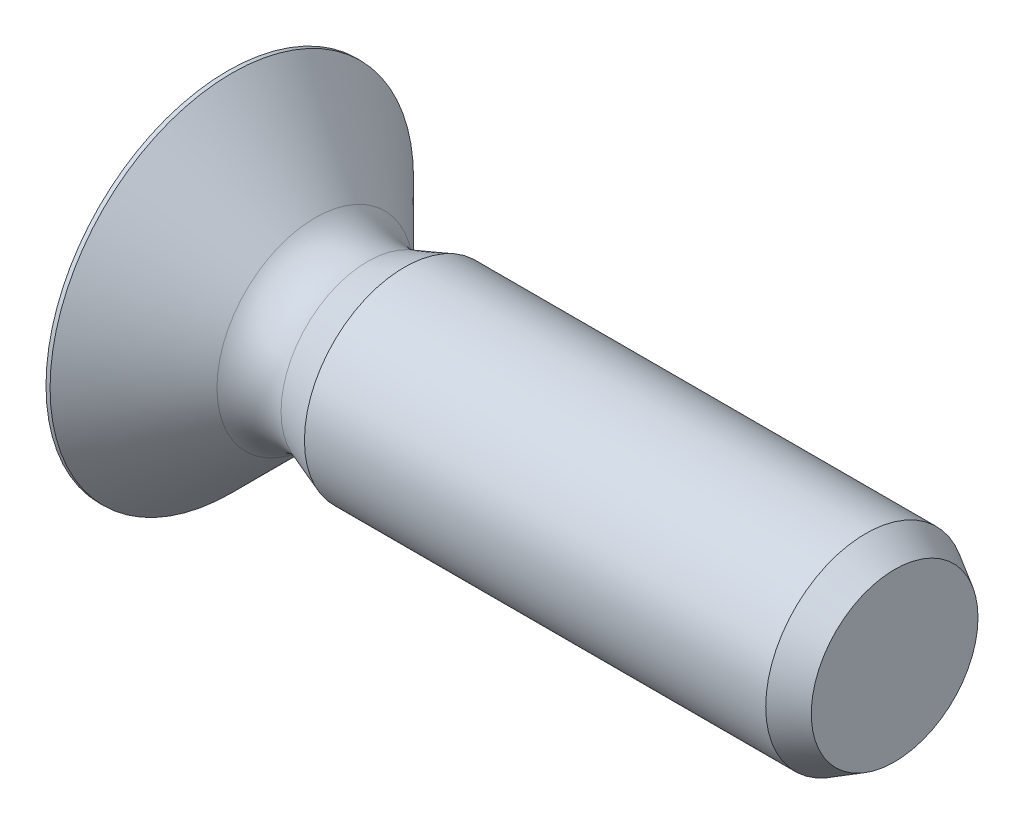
ISO-10303-21;
HEADER;
FILE_DESCRIPTION(('STEP AP214'),'2;1');
FILE_NAME('part.step','',(''),(''),'','','');
FILE_SCHEMA(('AUTOMOTIVE_DESIGN { 1 0 10303 214 1 1 1 1 }'));
ENDSEC;
DATA;
#1=APPLICATION_CONTEXT('core data for automotive mechanical design processes');
#2=APPLICATION_PROTOCOL_DEFINITION('international standard','automotive_design',2000,#1);
#3=PRODUCT_CONTEXT('',#1,'mechanical');
#4=PRODUCT('Part','Part','',(#3));
#5=PRODUCT_RELATED_PRODUCT_CATEGORY('part','',(#4));
#6=PRODUCT_DEFINITION_FORMATION('','',#4);
#7=PRODUCT_DEFINITION_CONTEXT('part definition',#1,'design');
#8=PRODUCT_DEFINITION('design','',#6,#7);
#9=PRODUCT_DEFINITION_SHAPE('','',#8);
#10=(LENGTH_UNIT() NAMED_UNIT(*) SI_UNIT(.MILLI.,.METRE.));
#11=(NAMED_UNIT(*) PLANE_ANGLE_UNIT() SI_UNIT($,.RADIAN.));
#12=(NAMED_UNIT(*) SI_UNIT($,.STERADIAN.) SOLID_ANGLE_UNIT());
#13=UNCERTAINTY_MEASURE_WITH_UNIT(LENGTH_MEASURE(1.E-05),#10,'distance_accuracy_value','');
#14=(GEOMETRIC_REPRESENTATION_CONTEXT(3) GLOBAL_UNCERTAINTY_ASSIGNED_CONTEXT((#13)) GLOBAL_UNIT_ASSIGNED_CONTEXT((#10,
#11,#12)) REPRESENTATION_CONTEXT('',''));
#15=CARTESIAN_POINT('',(0.,0.,0.));
#16=DIRECTION('',(0.,0.,1.));
#17=DIRECTION('',(1.,0.,0.));
#18=AXIS2_PLACEMENT_3D('',#15,#16,#17);
#19=CARTESIAN_POINT('',(0.,5.45,0.));
#20=DIRECTION('',(1.,0.,0.));
#21=DIRECTION('',(0.,0.,-1.));
#22=AXIS2_PLACEMENT_3D('',#19,#20,#21);
#23=PLANE('',#22);
#24=CARTESIAN_POINT('',(0.,0.,0.));
#25=DIRECTION('',(-1.,0.,0.));
#26=DIRECTION('',(0.,0.,1.));
#27=AXIS2_PLACEMENT_3D('',#24,#25,#26);
#28=CIRCLE('',#27,5.45);
#29=CARTESIAN_POINT('',(0.,0.,5.45));
#30=VERTEX_POINT('',#29);
#31=EDGE_CURVE('E178',#30,#30,#28,.T.);
#32=ORIENTED_EDGE('',*,*,#31,.T.);
#33=EDGE_LOOP('',(#32));
#34=FACE_BOUND('',#33,.T.);
#35=DIRECTION('',(0.,-1.,0.));
#36=VECTOR('',#35,1.);
#37=CARTESIAN_POINT('',(0.,3.65,0.73));
#38=LINE('',#37,#36);
#39=CARTESIAN_POINT('',(0.,3.65,0.73));
#40=VERTEX_POINT('',#39);
#41=CARTESIAN_POINT('',(0.,0.729999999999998,0.73));
#42=VERTEX_POINT('',#41);
#43=EDGE_CURVE('E54',#40,#42,#38,.T.);
#44=ORIENTED_EDGE('',*,*,#43,.T.);
#45=DIRECTION('',(0.,0.,1.));
#46=VECTOR('',#45,1.);
#47=CARTESIAN_POINT('',(0.,0.729999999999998,0.73));
#48=LINE('',#47,#46);
#49=CARTESIAN_POINT('',(0.,0.729999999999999,3.65));
#50=VERTEX_POINT('',#49);
#51=EDGE_CURVE('E163',#42,#50,#48,.T.);
#52=ORIENTED_EDGE('',*,*,#51,.T.);
#53=DIRECTION('',(0.,-1.,0.));
#54=VECTOR('',#53,1.);
#55=CARTESIAN_POINT('',(0.,0.729999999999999,3.65));
#56=LINE('',#55,#54);
#57=CARTESIAN_POINT('',(0.,-0.729999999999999,3.65));
#58=VERTEX_POINT('',#57);
#59=EDGE_CURVE('E456',#50,#58,#56,.T.);
#60=ORIENTED_EDGE('',*,*,#59,.T.);
#61=DIRECTION('',(0.,0.,-1.));
#62=VECTOR('',#61,1.);
#63=CARTESIAN_POINT('',(0.,-0.729999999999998,0.73));
#64=LINE('',#63,#62);
#65=CARTESIAN_POINT('',(0.,-0.729999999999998,0.73));
#66=VERTEX_POINT('',#65);
#67=EDGE_CURVE('E451',#58,#66,#64,.T.);
#68=ORIENTED_EDGE('',*,*,#67,.T.);
#69=DIRECTION('',(0.,-1.,0.));
#70=VECTOR('',#69,1.);
#71=CARTESIAN_POINT('',(0.,-3.65,0.729999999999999));
#72=LINE('',#71,#70);
#73=CARTESIAN_POINT('',(0.,-3.65,0.729999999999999));
#74=VERTEX_POINT('',#73);
#75=EDGE_CURVE('E298',#66,#74,#72,.T.);
#76=ORIENTED_EDGE('',*,*,#75,.T.);
#77=DIRECTION('',(0.,0.,-1.));
#78=VECTOR('',#77,1.);
#79=CARTESIAN_POINT('',(0.,-3.65,-0.729999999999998));
#80=LINE('',#79,#78);
#81=CARTESIAN_POINT('',(0.,-3.65,-0.729999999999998));
#82=VERTEX_POINT('',#81);
#83=EDGE_CURVE('E296',#74,#82,#80,.T.);
#84=ORIENTED_EDGE('',*,*,#83,.T.);
#85=DIRECTION('',(0.,1.,0.));
#86=VECTOR('',#85,1.);
#87=CARTESIAN_POINT('',(0.,-3.65,-0.729999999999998));
#88=LINE('',#87,#86);
#89=CARTESIAN_POINT('',(0.,-0.729999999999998,-0.73));
#90=VERTEX_POINT('',#89);
#91=EDGE_CURVE('E288',#82,#90,#88,.T.);
#92=ORIENTED_EDGE('',*,*,#91,.T.);
#93=DIRECTION('',(0.,0.,-1.));
#94=VECTOR('',#93,1.);
#95=CARTESIAN_POINT('',(0.,-0.729999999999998,-0.73));
#96=LINE('',#95,#94);
#97=CARTESIAN_POINT('',(0.,-0.729999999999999,-3.65));
#98=VERTEX_POINT('',#97);
#99=EDGE_CURVE('E291',#90,#98,#96,.T.);
#100=ORIENTED_EDGE('',*,*,#99,.T.);
#101=DIRECTION('',(0.,1.,0.));
#102=VECTOR('',#101,1.);
#103=CARTESIAN_POINT('',(0.,0.729999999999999,-3.65));
#104=LINE('',#103,#102);
#105=CARTESIAN_POINT('',(0.,0.729999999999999,-3.65));
#106=VERTEX_POINT('',#105);
#107=EDGE_CURVE('E281',#98,#106,#104,.T.);
#108=ORIENTED_EDGE('',*,*,#107,.T.);
#109=DIRECTION('',(0.,0.,1.));
#110=VECTOR('',#109,1.);
#111=CARTESIAN_POINT('',(0.,0.729999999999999,-0.73));
#112=LINE('',#111,#110);
#113=CARTESIAN_POINT('',(0.,0.729999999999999,-0.73));
#114=VERTEX_POINT('',#113);
#115=EDGE_CURVE('E279',#106,#114,#112,.T.);
#116=ORIENTED_EDGE('',*,*,#115,.T.);
#117=DIRECTION('',(0.,1.,0.));
#118=VECTOR('',#117,1.);
#119=CARTESIAN_POINT('',(0.,3.65,-0.729999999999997));
#120=LINE('',#119,#118);
#121=CARTESIAN_POINT('',(0.,3.65,-0.729999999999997));
#122=VERTEX_POINT('',#121);
#123=EDGE_CURVE('E275',#114,#122,#120,.T.);
#124=ORIENTED_EDGE('',*,*,#123,.T.);
#125=DIRECTION('',(0.,0.,1.));
#126=VECTOR('',#125,1.);
#127=CARTESIAN_POINT('',(0.,3.65,-0.729999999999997));
#128=LINE('',#127,#126);
#129=EDGE_CURVE('E159',#122,#40,#128,.T.);
#130=ORIENTED_EDGE('',*,*,#129,.T.);
#131=EDGE_LOOP('',(#44,#52,#60,#68,#76,#84,#92,#100,#108,#116,#124,#130));
#132=FACE_BOUND('',#131,.T.);
#133=ADVANCED_FACE('F37',(#34,#132),#23,.F.);
#134=CARTESIAN_POINT('',(-38.1054061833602,0.,0.));
#135=DIRECTION('',(-1.,0.,0.));
#136=DIRECTION('',(0.,0.,1.));
#137=AXIS2_PLACEMENT_3D('',#134,#135,#136);
#138=CYLINDRICAL_SURFACE('',#137,3.);
#139=CARTESIAN_POINT('',(5.3,0.,0.));
#140=DIRECTION('',(-1.,0.,0.));
#141=DIRECTION('',(0.,0.,1.));
#142=AXIS2_PLACEMENT_3D('',#139,#140,#141);
#143=CIRCLE('',#142,3.);
#144=CARTESIAN_POINT('',(5.3,0.,3.));
#145=VERTEX_POINT('',#144);
#146=EDGE_CURVE('E185',#145,#145,#143,.T.);
#147=ORIENTED_EDGE('',*,*,#146,.F.);
#148=EDGE_LOOP('',(#147));
#149=FACE_BOUND('',#148,.T.);
#150=CARTESIAN_POINT('',(19.1339745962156,0.,0.));
#151=DIRECTION('',(1.,0.,0.));
#152=DIRECTION('',(0.,0.,-1.));
#153=AXIS2_PLACEMENT_3D('',#150,#151,#152);
#154=CIRCLE('',#153,3.);
#155=CARTESIAN_POINT('',(19.1339745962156,0.,-3.));
#156=VERTEX_POINT('',#155);
#157=EDGE_CURVE('E164',#156,#156,#154,.T.);
#158=ORIENTED_EDGE('',*,*,#157,.F.);
#159=EDGE_LOOP('',(#158));
#160=FACE_BOUND('',#159,.T.);
#161=ADVANCED_FACE('F224',(#149,#160),#138,.T.);
#162=CARTESIAN_POINT('',(5.3,0.,0.));
#163=DIRECTION('',(1.,0.,0.));
#164=DIRECTION('',(0.,0.,-1.));
#165=AXIS2_PLACEMENT_3D('',#162,#163,#164);
#166=CONICAL_SURFACE('',#165,3.,0.349065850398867);
#167=CARTESIAN_POINT('',(4.19797533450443,0.,0.));
#168=DIRECTION('',(1.,0.,0.));
#169=DIRECTION('',(0.,0.,-1.));
#170=AXIS2_PLACEMENT_3D('',#167,#168,#169);
#171=CIRCLE('',#170,2.59889582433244);
#172=CARTESIAN_POINT('',(4.19797533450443,0.,-2.59889582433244));
#173=VERTEX_POINT('',#172);
#174=EDGE_CURVE('E11',#173,#173,#171,.T.);
#175=ORIENTED_EDGE('',*,*,#174,.T.);
#176=EDGE_LOOP('',(#175));
#177=FACE_BOUND('',#176,.T.);
#178=ORIENTED_EDGE('',*,*,#146,.T.);
#179=EDGE_LOOP('',(#178));
#180=FACE_BOUND('',#179,.T.);
#181=ADVANCED_FACE('F230',(#177,#180),#166,.T.);
#182=CARTESIAN_POINT('',(3.3,0.,0.));
#183=DIRECTION('',(-1.,0.,0.));
#184=DIRECTION('',(0.,0.,1.));
#185=AXIS2_PLACEMENT_3D('',#182,#183,#184);
#186=CONICAL_SURFACE('',#185,2.27205953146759,0.785398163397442);
#187=CARTESIAN_POINT('',(2.62428494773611,0.,0.));
#188=DIRECTION('',(-1.,0.,0.));
#189=DIRECTION('',(0.,0.,1.));
#190=AXIS2_PLACEMENT_3D('',#187,#188,#189);
#191=CIRCLE('',#190,2.94777458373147);
#192=CARTESIAN_POINT('',(2.62428494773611,0.,2.94777458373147));
#193=VERTEX_POINT('',#192);
#194=EDGE_CURVE('E46',#193,#193,#191,.T.);
#195=ORIENTED_EDGE('',*,*,#194,.T.);
#196=EDGE_LOOP('',(#195));
#197=FACE_BOUND('',#196,.T.);
#198=CARTESIAN_POINT('',(0.122059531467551,0.,0.));
#199=DIRECTION('',(-1.,0.,0.));
#200=DIRECTION('',(0.,0.,1.));
#201=AXIS2_PLACEMENT_3D('',#198,#199,#200);
#202=CIRCLE('',#201,5.45);
#203=CARTESIAN_POINT('',(0.122059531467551,0.,5.45));
#204=VERTEX_POINT('',#203);
#205=EDGE_CURVE('E181',#204,#204,#202,.T.);
#206=ORIENTED_EDGE('',*,*,#205,.F.);
#207=EDGE_LOOP('',(#206));
#208=FACE_BOUND('',#207,.T.);
#209=ADVANCED_FACE('F212',(#197,#208),#186,.T.);
#210=CARTESIAN_POINT('',(-38.1054061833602,0.,0.));
#211=DIRECTION('',(-1.,0.,0.));
#212=DIRECTION('',(0.,0.,1.));
#213=AXIS2_PLACEMENT_3D('',#210,#211,#212);
#214=CYLINDRICAL_SURFACE('',#213,5.45);
#215=ORIENTED_EDGE('',*,*,#31,.F.);
#216=EDGE_LOOP('',(#215));
#217=FACE_BOUND('',#216,.T.);
#218=ORIENTED_EDGE('',*,*,#205,.T.);
#219=EDGE_LOOP('',(#218));
#220=FACE_BOUND('',#219,.T.);
#221=ADVANCED_FACE('F238',(#217,#220),#214,.T.);
#222=CARTESIAN_POINT('',(20.,0.,0.));
#223=DIRECTION('',(-1.,0.,0.));
#224=DIRECTION('',(0.,0.,1.));
#225=AXIS2_PLACEMENT_3D('',#222,#223,#224);
#226=CONICAL_SURFACE('',#225,2.5,0.523598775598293);
#227=ORIENTED_EDGE('',*,*,#157,.T.);
#228=EDGE_LOOP('',(#227));
#229=FACE_BOUND('',#228,.T.);
#230=CARTESIAN_POINT('',(20.,0.,0.));
#231=DIRECTION('',(1.,0.,0.));
#232=DIRECTION('',(0.,0.,-1.));
#233=AXIS2_PLACEMENT_3D('',#230,#231,#232);
#234=CIRCLE('',#233,2.5);
#235=CARTESIAN_POINT('',(20.,0.,-2.5));
#236=VERTEX_POINT('',#235);
#237=EDGE_CURVE('E168',#236,#236,#234,.T.);
#238=ORIENTED_EDGE('',*,*,#237,.F.);
#239=EDGE_LOOP('',(#238));
#240=FACE_BOUND('',#239,.T.);
#241=ADVANCED_FACE('F236',(#229,#240),#226,.T.);
#242=CARTESIAN_POINT('',(20.,0.,0.));
#243=DIRECTION('',(-1.,0.,0.));
#244=DIRECTION('',(0.,0.,1.));
#245=AXIS2_PLACEMENT_3D('',#242,#243,#244);
#246=PLANE('',#245);
#247=ORIENTED_EDGE('',*,*,#237,.T.);
#248=EDGE_LOOP('',(#247));
#249=FACE_BOUND('',#248,.T.);
#250=ADVANCED_FACE('F247',(#249),#246,.F.);
#251=CARTESIAN_POINT('',(1.65,3.65,0.73));
#252=DIRECTION('',(0.,0.,-1.));
#253=DIRECTION('',(0.,1.,0.));
#254=AXIS2_PLACEMENT_3D('',#251,#252,#253);
#255=PLANE('',#254);
#256=ORIENTED_EDGE('',*,*,#43,.F.);
#257=DIRECTION('',(-0.707106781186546,0.707106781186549,0.));
#258=VECTOR('',#257,1.);
#259=CARTESIAN_POINT('',(0.824999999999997,2.825,0.73));
#260=LINE('',#259,#258);
#261=CARTESIAN_POINT('',(1.65,1.99999999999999,0.73));
#262=VERTEX_POINT('',#261);
#263=EDGE_CURVE('E158',#262,#40,#260,.T.);
#264=ORIENTED_EDGE('',*,*,#263,.F.);
#265=DIRECTION('',(0.,-1.,0.));
#266=VECTOR('',#265,1.);
#267=CARTESIAN_POINT('',(1.65,3.65,0.73));
#268=LINE('',#267,#266);
#269=CARTESIAN_POINT('',(1.65,0.729999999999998,0.73));
#270=VERTEX_POINT('',#269);
#271=EDGE_CURVE('E149',#262,#270,#268,.T.);
#272=ORIENTED_EDGE('',*,*,#271,.T.);
#273=DIRECTION('',(-1.,0.,0.));
#274=VECTOR('',#273,1.);
#275=CARTESIAN_POINT('',(1.65,0.729999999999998,0.73));
#276=LINE('',#275,#274);
#277=EDGE_CURVE('E157',#270,#42,#276,.T.);
#278=ORIENTED_EDGE('',*,*,#277,.T.);
#279=EDGE_LOOP('',(#256,#264,#272,#278));
#280=FACE_BOUND('',#279,.T.);
#281=ADVANCED_FACE('F156',(#280),#255,.T.);
#282=CARTESIAN_POINT('',(1.65,0.729999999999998,0.73));
#283=DIRECTION('',(0.,-1.,0.));
#284=DIRECTION('',(0.,0.,-1.));
#285=AXIS2_PLACEMENT_3D('',#282,#283,#284);
#286=PLANE('',#285);
#287=ORIENTED_EDGE('',*,*,#51,.F.);
#288=ORIENTED_EDGE('',*,*,#277,.F.);
#289=DIRECTION('',(0.,0.,1.));
#290=VECTOR('',#289,1.);
#291=CARTESIAN_POINT('',(1.65,0.729999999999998,0.73));
#292=LINE('',#291,#290);
#293=CARTESIAN_POINT('',(1.65,0.729999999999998,2.));
#294=VERTEX_POINT('',#293);
#295=EDGE_CURVE('E145',#270,#294,#292,.T.);
#296=ORIENTED_EDGE('',*,*,#295,.T.);
#297=DIRECTION('',(-0.707106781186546,0.,0.707106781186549));
#298=VECTOR('',#297,1.);
#299=CARTESIAN_POINT('',(0.,0.729999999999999,3.65));
#300=LINE('',#299,#298);
#301=EDGE_CURVE('E165',#294,#50,#300,.T.);
#302=ORIENTED_EDGE('',*,*,#301,.T.);
#303=EDGE_LOOP('',(#287,#288,#296,#302));
#304=FACE_BOUND('',#303,.T.);
#305=ADVANCED_FACE('F161',(#304),#286,.T.);
#306=CARTESIAN_POINT('',(0.,0.729999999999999,3.65));
#307=DIRECTION('',(-0.707106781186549,0.,-0.707106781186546));
#308=DIRECTION('',(-0.707106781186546,0.,0.707106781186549));
#309=AXIS2_PLACEMENT_3D('',#306,#307,#308);
#310=PLANE('',#309);
#311=ORIENTED_EDGE('',*,*,#59,.F.);
#312=ORIENTED_EDGE('',*,*,#301,.F.);
#313=DIRECTION('',(0.,-1.,0.));
#314=VECTOR('',#313,1.);
#315=CARTESIAN_POINT('',(1.65,0.729999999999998,2.));
#316=LINE('',#315,#314);
#317=CARTESIAN_POINT('',(1.65,-0.729999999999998,2.));
#318=VERTEX_POINT('',#317);
#319=EDGE_CURVE('E151',#294,#318,#316,.T.);
#320=ORIENTED_EDGE('',*,*,#319,.T.);
#321=DIRECTION('',(-0.707106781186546,0.,0.707106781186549));
#322=VECTOR('',#321,1.);
#323=CARTESIAN_POINT('',(2.285,-0.729999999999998,1.365));
#324=LINE('',#323,#322);
#325=EDGE_CURVE('E170',#318,#58,#324,.T.);
#326=ORIENTED_EDGE('',*,*,#325,.T.);
#327=EDGE_LOOP('',(#311,#312,#320,#326));
#328=FACE_BOUND('',#327,.T.);
#329=ADVANCED_FACE('F262',(#328),#310,.T.);
#330=CARTESIAN_POINT('',(1.65,-0.729999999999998,0.73));
#331=DIRECTION('',(0.,1.,0.));
#332=DIRECTION('',(0.,0.,1.));
#333=AXIS2_PLACEMENT_3D('',#330,#331,#332);
#334=PLANE('',#333);
#335=ORIENTED_EDGE('',*,*,#67,.F.);
#336=ORIENTED_EDGE('',*,*,#325,.F.);
#337=DIRECTION('',(0.,0.,-1.));
#338=VECTOR('',#337,1.);
#339=CARTESIAN_POINT('',(1.65,-0.729999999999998,0.73));
#340=LINE('',#339,#338);
#341=CARTESIAN_POINT('',(1.65,-0.729999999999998,0.73));
#342=VERTEX_POINT('',#341);
#343=EDGE_CURVE('E202',#318,#342,#340,.T.);
#344=ORIENTED_EDGE('',*,*,#343,.T.);
#345=DIRECTION('',(-1.,0.,0.));
#346=VECTOR('',#345,1.);
#347=CARTESIAN_POINT('',(1.65,-0.729999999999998,0.73));
#348=LINE('',#347,#346);
#349=EDGE_CURVE('E173',#342,#66,#348,.T.);
#350=ORIENTED_EDGE('',*,*,#349,.T.);
#351=EDGE_LOOP('',(#335,#336,#344,#350));
#352=FACE_BOUND('',#351,.T.);
#353=ADVANCED_FACE('F264',(#352),#334,.T.);
#354=CARTESIAN_POINT('',(1.65,-3.65,0.729999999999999));
#355=DIRECTION('',(0.,0.,-1.));
#356=DIRECTION('',(0.,1.,0.));
#357=AXIS2_PLACEMENT_3D('',#354,#355,#356);
#358=PLANE('',#357);
#359=ORIENTED_EDGE('',*,*,#75,.F.);
#360=ORIENTED_EDGE('',*,*,#349,.F.);
#361=DIRECTION('',(0.,-1.,0.));
#362=VECTOR('',#361,1.);
#363=CARTESIAN_POINT('',(1.65,-3.65,0.729999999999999));
#364=LINE('',#363,#362);
#365=CARTESIAN_POINT('',(1.65,-1.99999999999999,0.729999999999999));
#366=VERTEX_POINT('',#365);
#367=EDGE_CURVE('E194',#342,#366,#364,.T.);
#368=ORIENTED_EDGE('',*,*,#367,.T.);
#369=DIRECTION('',(-0.707106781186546,-0.707106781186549,0.));
#370=VECTOR('',#369,1.);
#371=CARTESIAN_POINT('',(0.,-3.65,0.729999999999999));
#372=LINE('',#371,#370);
#373=EDGE_CURVE('E190',#366,#74,#372,.T.);
#374=ORIENTED_EDGE('',*,*,#373,.T.);
#375=EDGE_LOOP('',(#359,#360,#368,#374));
#376=FACE_BOUND('',#375,.T.);
#377=ADVANCED_FACE('F255',(#376),#358,.T.);
#378=CARTESIAN_POINT('',(0.,-3.65,-0.729999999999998));
#379=DIRECTION('',(-0.707106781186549,0.707106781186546,0.));
#380=DIRECTION('',(-0.707106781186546,-0.707106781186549,0.));
#381=AXIS2_PLACEMENT_3D('',#378,#379,#380);
#382=PLANE('',#381);
#383=ORIENTED_EDGE('',*,*,#83,.F.);
#384=ORIENTED_EDGE('',*,*,#373,.F.);
#385=DIRECTION('',(0.,0.,-1.));
#386=VECTOR('',#385,1.);
#387=CARTESIAN_POINT('',(1.65,-1.99999999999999,0.730000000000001));
#388=LINE('',#387,#386);
#389=CARTESIAN_POINT('',(1.65,-1.99999999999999,-0.729999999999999));
#390=VERTEX_POINT('',#389);
#391=EDGE_CURVE('E192',#366,#390,#388,.T.);
#392=ORIENTED_EDGE('',*,*,#391,.T.);
#393=DIRECTION('',(-0.707106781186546,-0.707106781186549,0.));
#394=VECTOR('',#393,1.);
#395=CARTESIAN_POINT('',(0.824999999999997,-2.825,-0.729999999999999));
#396=LINE('',#395,#394);
#397=EDGE_CURVE('E188',#390,#82,#396,.T.);
#398=ORIENTED_EDGE('',*,*,#397,.T.);
#399=EDGE_LOOP('',(#383,#384,#392,#398));
#400=FACE_BOUND('',#399,.T.);
#401=ADVANCED_FACE('F251',(#400),#382,.T.);
#402=CARTESIAN_POINT('',(1.65,-3.65,-0.729999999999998));
#403=DIRECTION('',(0.,0.,1.));
#404=DIRECTION('',(0.,-1.,0.));
#405=AXIS2_PLACEMENT_3D('',#402,#403,#404);
#406=PLANE('',#405);
#407=ORIENTED_EDGE('',*,*,#91,.F.);
#408=ORIENTED_EDGE('',*,*,#397,.F.);
#409=DIRECTION('',(0.,1.,0.));
#410=VECTOR('',#409,1.);
#411=CARTESIAN_POINT('',(1.65,-3.65,-0.729999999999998));
#412=LINE('',#411,#410);
#413=CARTESIAN_POINT('',(1.65,-0.729999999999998,-0.73));
#414=VERTEX_POINT('',#413);
#415=EDGE_CURVE('E102',#390,#414,#412,.T.);
#416=ORIENTED_EDGE('',*,*,#415,.T.);
#417=DIRECTION('',(-1.,0.,0.));
#418=VECTOR('',#417,1.);
#419=CARTESIAN_POINT('',(1.65,-0.729999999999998,-0.73));
#420=LINE('',#419,#418);
#421=EDGE_CURVE('E191',#414,#90,#420,.T.);
#422=ORIENTED_EDGE('',*,*,#421,.T.);
#423=EDGE_LOOP('',(#407,#408,#416,#422));
#424=FACE_BOUND('',#423,.T.);
#425=ADVANCED_FACE('F254',(#424),#406,.T.);
#426=CARTESIAN_POINT('',(1.65,-0.729999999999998,-0.73));
#427=DIRECTION('',(0.,1.,0.));
#428=DIRECTION('',(0.,0.,1.));
#429=AXIS2_PLACEMENT_3D('',#426,#427,#428);
#430=PLANE('',#429);
#431=ORIENTED_EDGE('',*,*,#99,.F.);
#432=ORIENTED_EDGE('',*,*,#421,.F.);
#433=DIRECTION('',(0.,0.,-1.));
#434=VECTOR('',#433,1.);
#435=CARTESIAN_POINT('',(1.65,-0.729999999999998,-0.73));
#436=LINE('',#435,#434);
#437=CARTESIAN_POINT('',(1.65,-0.729999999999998,-2.));
#438=VERTEX_POINT('',#437);
#439=EDGE_CURVE('E95',#414,#438,#436,.T.);
#440=ORIENTED_EDGE('',*,*,#439,.T.);
#441=DIRECTION('',(-0.707106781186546,0.,-0.707106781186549));
#442=VECTOR('',#441,1.);
#443=CARTESIAN_POINT('',(0.,-0.729999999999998,-3.65));
#444=LINE('',#443,#442);
#445=EDGE_CURVE('E206',#438,#98,#444,.T.);
#446=ORIENTED_EDGE('',*,*,#445,.T.);
#447=EDGE_LOOP('',(#431,#432,#440,#446));
#448=FACE_BOUND('',#447,.T.);
#449=ADVANCED_FACE('F261',(#448),#430,.T.);
#450=CARTESIAN_POINT('',(0.,0.729999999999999,-3.65));
#451=DIRECTION('',(-0.707106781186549,0.,0.707106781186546));
#452=DIRECTION('',(0.707106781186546,0.,0.707106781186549));
#453=AXIS2_PLACEMENT_3D('',#450,#451,#452);
#454=PLANE('',#453);
#455=ORIENTED_EDGE('',*,*,#107,.F.);
#456=ORIENTED_EDGE('',*,*,#445,.F.);
#457=DIRECTION('',(0.,1.,0.));
#458=VECTOR('',#457,1.);
#459=CARTESIAN_POINT('',(1.65,0.729999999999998,-2.));
#460=LINE('',#459,#458);
#461=CARTESIAN_POINT('',(1.65,0.729999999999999,-2.));
#462=VERTEX_POINT('',#461);
#463=EDGE_CURVE('E86',#438,#462,#460,.T.);
#464=ORIENTED_EDGE('',*,*,#463,.T.);
#465=DIRECTION('',(-0.707106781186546,0.,-0.707106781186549));
#466=VECTOR('',#465,1.);
#467=CARTESIAN_POINT('',(2.285,0.729999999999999,-1.365));
#468=LINE('',#467,#466);
#469=EDGE_CURVE('E204',#462,#106,#468,.T.);
#470=ORIENTED_EDGE('',*,*,#469,.T.);
#471=EDGE_LOOP('',(#455,#456,#464,#470));
#472=FACE_BOUND('',#471,.T.);
#473=ADVANCED_FACE('F257',(#472),#454,.T.);
#474=CARTESIAN_POINT('',(1.65,0.729999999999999,-0.73));
#475=DIRECTION('',(0.,-1.,0.));
#476=DIRECTION('',(0.,0.,-1.));
#477=AXIS2_PLACEMENT_3D('',#474,#475,#476);
#478=PLANE('',#477);
#479=ORIENTED_EDGE('',*,*,#115,.F.);
#480=ORIENTED_EDGE('',*,*,#469,.F.);
#481=DIRECTION('',(0.,0.,1.));
#482=VECTOR('',#481,1.);
#483=CARTESIAN_POINT('',(1.65,0.729999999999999,-0.73));
#484=LINE('',#483,#482);
#485=CARTESIAN_POINT('',(1.65,0.729999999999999,-0.73));
#486=VERTEX_POINT('',#485);
#487=EDGE_CURVE('E208',#462,#486,#484,.T.);
#488=ORIENTED_EDGE('',*,*,#487,.T.);
#489=DIRECTION('',(-1.,0.,0.));
#490=VECTOR('',#489,1.);
#491=CARTESIAN_POINT('',(1.65,0.729999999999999,-0.73));
#492=LINE('',#491,#490);
#493=EDGE_CURVE('E134',#486,#114,#492,.T.);
#494=ORIENTED_EDGE('',*,*,#493,.T.);
#495=EDGE_LOOP('',(#479,#480,#488,#494));
#496=FACE_BOUND('',#495,.T.);
#497=ADVANCED_FACE('F260',(#496),#478,.T.);
#498=CARTESIAN_POINT('',(1.65,3.65,-0.729999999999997));
#499=DIRECTION('',(0.,0.,1.));
#500=DIRECTION('',(0.,-1.,0.));
#501=AXIS2_PLACEMENT_3D('',#498,#499,#500);
#502=PLANE('',#501);
#503=ORIENTED_EDGE('',*,*,#123,.F.);
#504=ORIENTED_EDGE('',*,*,#493,.F.);
#505=DIRECTION('',(0.,1.,0.));
#506=VECTOR('',#505,1.);
#507=CARTESIAN_POINT('',(1.65,3.65,-0.729999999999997));
#508=LINE('',#507,#506);
#509=CARTESIAN_POINT('',(1.65,1.99999999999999,-0.729999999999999));
#510=VERTEX_POINT('',#509);
#511=EDGE_CURVE('E199',#486,#510,#508,.T.);
#512=ORIENTED_EDGE('',*,*,#511,.T.);
#513=DIRECTION('',(-0.707106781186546,0.707106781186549,0.));
#514=VECTOR('',#513,1.);
#515=CARTESIAN_POINT('',(0.,3.65,-0.729999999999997));
#516=LINE('',#515,#514);
#517=EDGE_CURVE('E139',#510,#122,#516,.T.);
#518=ORIENTED_EDGE('',*,*,#517,.T.);
#519=EDGE_LOOP('',(#503,#504,#512,#518));
#520=FACE_BOUND('',#519,.T.);
#521=ADVANCED_FACE('F267',(#520),#502,.T.);
#522=CARTESIAN_POINT('',(0.,3.65,-0.729999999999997));
#523=DIRECTION('',(-0.707106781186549,-0.707106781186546,0.));
#524=DIRECTION('',(0.707106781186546,-0.707106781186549,0.));
#525=AXIS2_PLACEMENT_3D('',#522,#523,#524);
#526=PLANE('',#525);
#527=ORIENTED_EDGE('',*,*,#129,.F.);
#528=ORIENTED_EDGE('',*,*,#517,.F.);
#529=DIRECTION('',(0.,0.,1.));
#530=VECTOR('',#529,1.);
#531=CARTESIAN_POINT('',(1.65,1.99999999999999,0.73));
#532=LINE('',#531,#530);
#533=EDGE_CURVE('E197',#510,#262,#532,.T.);
#534=ORIENTED_EDGE('',*,*,#533,.T.);
#535=ORIENTED_EDGE('',*,*,#263,.T.);
#536=EDGE_LOOP('',(#527,#528,#534,#535));
#537=FACE_BOUND('',#536,.T.);
#538=ADVANCED_FACE('F220',(#537),#526,.T.);
#539=CARTESIAN_POINT('',(1.65,0.729999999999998,0.73));
#540=DIRECTION('',(-1.,0.,0.));
#541=DIRECTION('',(0.,0.,1.));
#542=AXIS2_PLACEMENT_3D('',#539,#540,#541);
#543=PLANE('',#542);
#544=ORIENTED_EDGE('',*,*,#271,.F.);
#545=ORIENTED_EDGE('',*,*,#533,.F.);
#546=ORIENTED_EDGE('',*,*,#511,.F.);
#547=ORIENTED_EDGE('',*,*,#487,.F.);
#548=ORIENTED_EDGE('',*,*,#463,.F.);
#549=ORIENTED_EDGE('',*,*,#439,.F.);
#550=ORIENTED_EDGE('',*,*,#415,.F.);
#551=ORIENTED_EDGE('',*,*,#391,.F.);
#552=ORIENTED_EDGE('',*,*,#367,.F.);
#553=ORIENTED_EDGE('',*,*,#343,.F.);
#554=ORIENTED_EDGE('',*,*,#319,.F.);
#555=ORIENTED_EDGE('',*,*,#295,.F.);
#556=EDGE_LOOP('',(#544,#545,#546,#547,#548,#549,#550,#551,#552,#553,#554,#555));
#557=FACE_BOUND('',#556,.T.);
#558=ADVANCED_FACE('F147',(#557),#543,.T.);
#559=CARTESIAN_POINT('',(3.68494511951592,0.,0.));
#560=DIRECTION('',(-1.,0.,0.));
#561=DIRECTION('',(0.,0.,1.));
#562=AXIS2_PLACEMENT_3D('',#559,#560,#561);
#563=TOROIDAL_SURFACE('',#562,4.0084347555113,1.5);
#564=ORIENTED_EDGE('',*,*,#174,.F.);
#565=EDGE_LOOP('',(#564));
#566=FACE_BOUND('',#565,.T.);
#567=ORIENTED_EDGE('',*,*,#194,.F.);
#568=EDGE_LOOP('',(#567));
#569=FACE_BOUND('',#568,.T.);
#570=ADVANCED_FACE('F39',(#566,#569),#563,.F.);
#571=CLOSED_SHELL('',(#133,#161,#181,#209,#221,#241,#250,#281,#305,#329,#353,#377,#401,#425,
#449,#473,#497,#521,#538,#558,#570));
#572=MANIFOLD_SOLID_BREP('B2',#571);
#573=ADVANCED_BREP_SHAPE_REPRESENTATION('',(#18,#572),#14);
#574=SHAPE_DEFINITION_REPRESENTATION(#9,#573);
ENDSEC;
END-ISO-10303-21;
